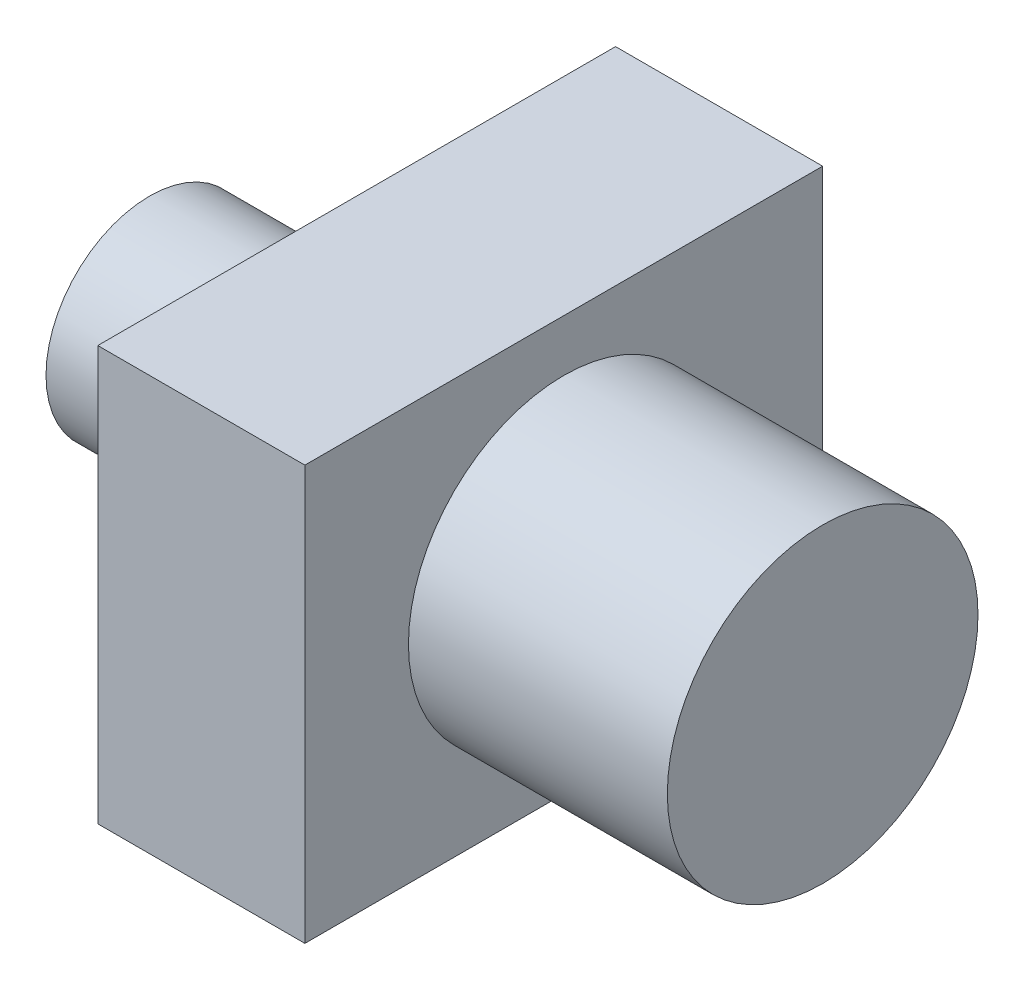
from build123d import *

# Parameters (mm, degrees)
SKETCH_1_W      = 100
SKETCH_1_H      = 80
EXTRUDE_1_DEPTH = 40
SKETCH_2_R      = 20
EXTRUDE_2_DEPTH = 40
SKETCH_3_R      = 30
EXTRUDE_3_DEPTH = 50


with BuildPart() as part:
    # Sketch 1 → Extrude 1 (new body)
    with BuildSketch(Plane(origin=(0, 0, 0), x_dir=(0, 0, -1), z_dir=(1, 0, 0))):
        Rectangle(SKETCH_1_W, SKETCH_1_H)
    extrude(amount=EXTRUDE_1_DEPTH)

    # Sketch 2 → Extrude 2 (add)
    with BuildSketch(Plane.ZY):
        with Locations(Location((0, 0, 0), (0, 0, 180))):
            Circle(SKETCH_2_R)
    extrude(amount=EXTRUDE_2_DEPTH)

    # Sketch 3 → Extrude 3 (add)
    with BuildSketch(Plane(origin=(40, 0, 0), x_dir=(0, 0, -1), z_dir=(1, 0, 0))):
        Circle(SKETCH_3_R)
    extrude(amount=EXTRUDE_3_DEPTH)


solid = part.part
